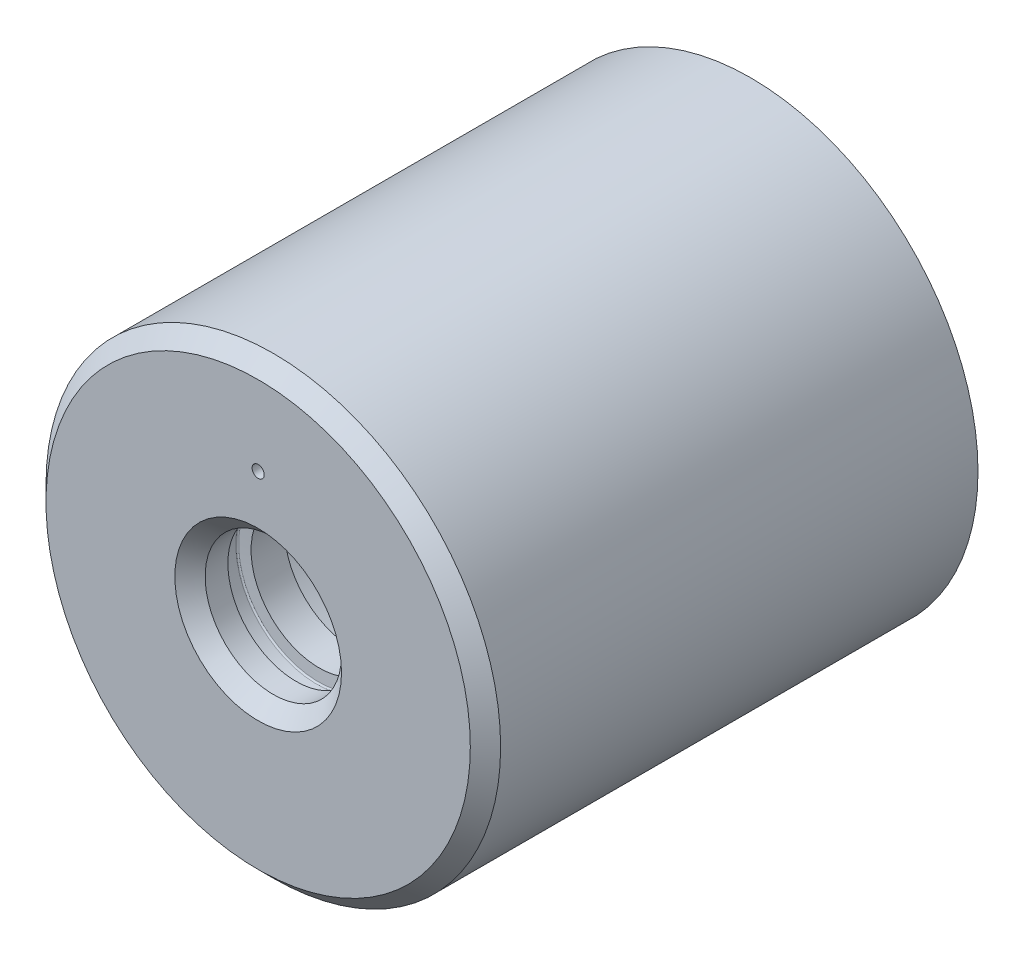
from build123d import *

# Parameters (mm, degrees)
SKETCH1_R     = 38.1
SKETCH1_R_2   = 26.67
TUBE_DEPTH    = 66.675
SKETCH2_R     = 38.1
SKETCH2_R_2   = 11.43
END_DEPTH     = 15.875
CHAMFER1_SIZE = 2.54
SKETCH3_R     = 1.016
VENT_DEPTH    = 99.578509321


with BuildPart() as part:
    # Sketch1 → tube (new body)
    with BuildSketch(Plane.XY):
        Circle(SKETCH1_R)
        Circle(SKETCH1_R_2, mode=Mode.SUBTRACT)
    extrude(amount=TUBE_DEPTH)

    # Sketch2 → end (add)
    with BuildSketch(Plane.XY.offset(66.675)):
        Circle(SKETCH2_R)
        Circle(SKETCH2_R_2, mode=Mode.SUBTRACT)
    extrude(amount=END_DEPTH)

    # Chamfer1
    chamfer1_edges = [part.edges().sort_by_distance(p)[0] for p in [
        (-11.43, 0, 82.55),
        (-38.1, 0, 82.55),
    ]]
    chamfer(chamfer1_edges, length=CHAMFER1_SIZE)

    # Sketch3 → vent (cut, through all)
    with BuildSketch(Plane.XY.offset(82.55)):
        with Locations((0, 22.225)):
            Circle(SKETCH3_R)
    extrude(amount=-VENT_DEPTH, mode=Mode.SUBTRACT)

    # Sketch5 → Groove for AS 568-118_ O-Ring1 (revolve, cut)
    with BuildSketch(Plane(origin=(0, 0, 82.55), x_dir=(0, 1, 0), z_dir=(-1, 0, 0)), mode=Mode.PRIVATE) as groove_for_as_568_118_o_ring1_sk:
        with BuildLine():
            Line((13.344437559, 10.073491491), (11.43, 10.240983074))
            Line((11.43, 10.240983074), (11.43, 6.35))
            Line((11.43, 6.35), (13.344437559, 6.517491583))
            ThreePointArc((13.344437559, 6.517491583), (13.509568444, 6.598925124), (13.5763, 6.770525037))
            Line((13.5763, 6.770525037), (13.5763, 9.820458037))
            ThreePointArc((13.5763, 9.820458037), (13.509568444, 9.99205795), (13.344437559, 10.073491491))
        make_face()
    revolve(groove_for_as_568_118_o_ring1_sk.sketch.rotate(Axis((0, 0, 32.55), (0, 0, 1)), 270), axis=Axis((0, 0, 32.55), (0, 0, 1)), mode=Mode.SUBTRACT)


solid = part.part
